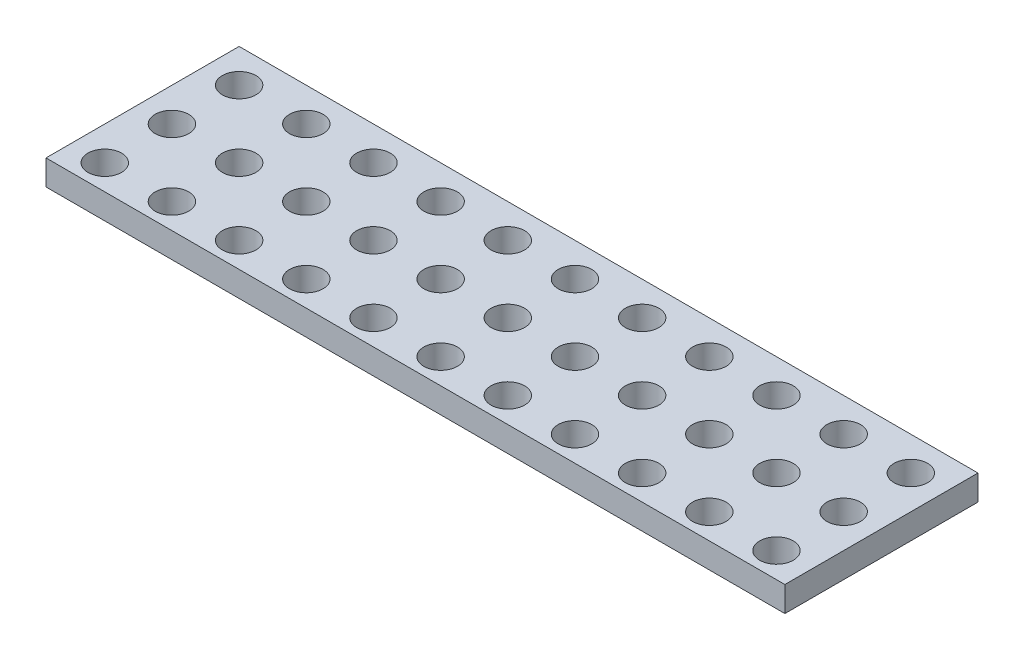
from build123d import *

# Parameters (mm, degrees)
SKETCH_1_W      = 88
SKETCH_1_H      = 23
SKETCH_1_R      = 2
EXTRUDE_1_DEPTH = 3


with BuildPart() as part:
    # Sketch 1 → Extrude 1 (new body)
    with BuildSketch(Plane(origin=(0, 0, 0), x_dir=(1, 0, 0), z_dir=(0, 1, 0))):
        with Locations((19.407407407, 0.203703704)):
            Rectangle(SKETCH_1_W, SKETCH_1_H)
        with Locations(Location((-20.592592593, 7.703703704, 0), (0, 0, 270))):
            Circle(SKETCH_1_R, mode=Mode.SUBTRACT)
        with Locations(Location((-12.592592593, 7.703703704, 0), (0, 0, 270))):
            Circle(SKETCH_1_R, mode=Mode.SUBTRACT)
        with Locations(Location((-4.592592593, 7.703703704, 0), (0, 0, 270))):
            Circle(SKETCH_1_R, mode=Mode.SUBTRACT)
        with Locations(Location((3.407407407, 7.703703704, 0), (0, 0, 270))):
            Circle(SKETCH_1_R, mode=Mode.SUBTRACT)
        with Locations(Location((11.407407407, 7.703703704, 0), (0, 0, 270))):
            Circle(SKETCH_1_R, mode=Mode.SUBTRACT)
        with Locations(Location((19.407407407, 7.703703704, 0), (0, 0, 270))):
            Circle(SKETCH_1_R, mode=Mode.SUBTRACT)
        with Locations(Location((27.407407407, 7.703703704, 0), (0, 0, 270))):
            Circle(SKETCH_1_R, mode=Mode.SUBTRACT)
        with Locations(Location((35.407407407, 7.703703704, 0), (0, 0, 270))):
            Circle(SKETCH_1_R, mode=Mode.SUBTRACT)
        with Locations(Location((43.407407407, 7.703703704, 0), (0, 0, 270))):
            Circle(SKETCH_1_R, mode=Mode.SUBTRACT)
        with Locations(Location((51.407407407, 7.703703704, 0), (0, 0, 270))):
            Circle(SKETCH_1_R, mode=Mode.SUBTRACT)
        with Locations(Location((59.407407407, 7.703703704, 0), (0, 0, 270))):
            Circle(SKETCH_1_R, mode=Mode.SUBTRACT)
        with Locations(Location((-12.592592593, -0.296296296, 0), (0, 0, 270))):
            Circle(SKETCH_1_R, mode=Mode.SUBTRACT)
        with Locations(Location((-4.592592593, -0.296296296, 0), (0, 0, 270))):
            Circle(SKETCH_1_R, mode=Mode.SUBTRACT)
        with Locations(Location((3.407407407, -0.296296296, 0), (0, 0, 270))):
            Circle(SKETCH_1_R, mode=Mode.SUBTRACT)
        with Locations(Location((11.407407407, -0.296296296, 0), (0, 0, 270))):
            Circle(SKETCH_1_R, mode=Mode.SUBTRACT)
        with Locations(Location((19.407407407, -0.296296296, 0), (0, 0, 270))):
            Circle(SKETCH_1_R, mode=Mode.SUBTRACT)
        with Locations(Location((27.407407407, -0.296296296, 0), (0, 0, 270))):
            Circle(SKETCH_1_R, mode=Mode.SUBTRACT)
        with Locations(Location((35.407407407, -0.296296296, 0), (0, 0, 270))):
            Circle(SKETCH_1_R, mode=Mode.SUBTRACT)
        with Locations(Location((43.407407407, -0.296296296, 0), (0, 0, 270))):
            Circle(SKETCH_1_R, mode=Mode.SUBTRACT)
        with Locations(Location((51.407407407, -0.296296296, 0), (0, 0, 270))):
            Circle(SKETCH_1_R, mode=Mode.SUBTRACT)
        with Locations(Location((59.407407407, -0.296296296, 0), (0, 0, 270))):
            Circle(SKETCH_1_R, mode=Mode.SUBTRACT)
        with Locations(Location((-20.592592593, -0.296296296, 0), (0, 0, 270))):
            Circle(SKETCH_1_R, mode=Mode.SUBTRACT)
        with Locations(Location((-12.592592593, -8.296296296, 0), (0, 0, 270))):
            Circle(SKETCH_1_R, mode=Mode.SUBTRACT)
        with Locations(Location((-4.592592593, -8.296296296, 0), (0, 0, 270))):
            Circle(SKETCH_1_R, mode=Mode.SUBTRACT)
        with Locations(Location((3.407407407, -8.296296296, 0), (0, 0, 270))):
            Circle(SKETCH_1_R, mode=Mode.SUBTRACT)
        with Locations(Location((11.407407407, -8.296296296, 0), (0, 0, 270))):
            Circle(SKETCH_1_R, mode=Mode.SUBTRACT)
        with Locations(Location((19.407407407, -8.296296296, 0), (0, 0, 270))):
            Circle(SKETCH_1_R, mode=Mode.SUBTRACT)
        with Locations(Location((27.407407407, -8.296296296, 0), (0, 0, 270))):
            Circle(SKETCH_1_R, mode=Mode.SUBTRACT)
        with Locations(Location((35.407407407, -8.296296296, 0), (0, 0, 270))):
            Circle(SKETCH_1_R, mode=Mode.SUBTRACT)
        with Locations(Location((43.407407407, -8.296296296, 0), (0, 0, 270))):
            Circle(SKETCH_1_R, mode=Mode.SUBTRACT)
        with Locations(Location((51.407407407, -8.296296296, 0), (0, 0, 270))):
            Circle(SKETCH_1_R, mode=Mode.SUBTRACT)
        with Locations(Location((59.407407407, -8.296296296, 0), (0, 0, 270))):
            Circle(SKETCH_1_R, mode=Mode.SUBTRACT)
        with Locations(Location((-20.592592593, -8.296296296, 0), (0, 0, 270))):
            Circle(SKETCH_1_R, mode=Mode.SUBTRACT)
    extrude(amount=EXTRUDE_1_DEPTH)


solid = part.part
